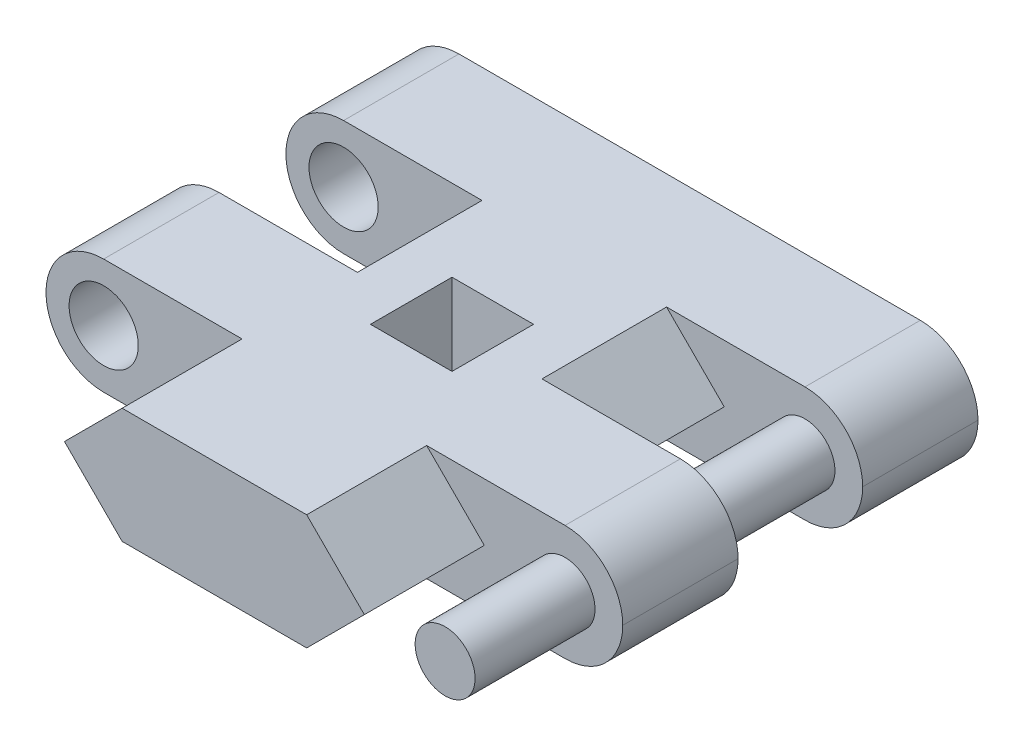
ISO-10303-21;
HEADER;
FILE_DESCRIPTION(('STEP AP214'),'2;1');
FILE_NAME('part.step','',(''),(''),'','','');
FILE_SCHEMA(('AUTOMOTIVE_DESIGN { 1 0 10303 214 1 1 1 1 }'));
ENDSEC;
DATA;
#1=APPLICATION_CONTEXT('core data for automotive mechanical design processes');
#2=APPLICATION_PROTOCOL_DEFINITION('international standard','automotive_design',2000,#1);
#3=PRODUCT_CONTEXT('',#1,'mechanical');
#4=PRODUCT('Part','Part','',(#3));
#5=PRODUCT_RELATED_PRODUCT_CATEGORY('part','',(#4));
#6=PRODUCT_DEFINITION_FORMATION('','',#4);
#7=PRODUCT_DEFINITION_CONTEXT('part definition',#1,'design');
#8=PRODUCT_DEFINITION('design','',#6,#7);
#9=PRODUCT_DEFINITION_SHAPE('','',#8);
#10=(LENGTH_UNIT() NAMED_UNIT(*) SI_UNIT(.MILLI.,.METRE.));
#11=(NAMED_UNIT(*) PLANE_ANGLE_UNIT() SI_UNIT($,.RADIAN.));
#12=(NAMED_UNIT(*) SI_UNIT($,.STERADIAN.) SOLID_ANGLE_UNIT());
#13=UNCERTAINTY_MEASURE_WITH_UNIT(LENGTH_MEASURE(1.E-05),#10,'distance_accuracy_value','');
#14=(GEOMETRIC_REPRESENTATION_CONTEXT(3) GLOBAL_UNCERTAINTY_ASSIGNED_CONTEXT((#13)) GLOBAL_UNIT_ASSIGNED_CONTEXT((#10,
#11,#12)) REPRESENTATION_CONTEXT('',''));
#15=CARTESIAN_POINT('',(0.,0.,0.));
#16=DIRECTION('',(0.,0.,1.));
#17=DIRECTION('',(1.,0.,0.));
#18=AXIS2_PLACEMENT_3D('',#15,#16,#17);
#19=CARTESIAN_POINT('',(0.,2.5,-10.3));
#20=DIRECTION('',(0.,0.,1.));
#21=DIRECTION('',(1.,0.,0.));
#22=AXIS2_PLACEMENT_3D('',#19,#20,#21);
#23=PLANE('',#22);
#24=CARTESIAN_POINT('',(-10.,0.,-10.3));
#25=DIRECTION('',(0.,0.,-1.));
#26=DIRECTION('',(-1.,0.,0.));
#27=AXIS2_PLACEMENT_3D('',#24,#25,#26);
#28=CIRCLE('',#27,1.5);
#29=CARTESIAN_POINT('',(-11.5,0.,-10.3));
#30=VERTEX_POINT('',#29);
#31=EDGE_CURVE('E258',#30,#30,#28,.T.);
#32=ORIENTED_EDGE('',*,*,#31,.F.);
#33=EDGE_LOOP('',(#32));
#34=FACE_BOUND('',#33,.T.);
#35=DIRECTION('',(-1.,0.,0.));
#36=VECTOR('',#35,1.);
#37=CARTESIAN_POINT('',(0.,2.5,-10.3));
#38=LINE('',#37,#36);
#39=CARTESIAN_POINT('',(10.,2.5,-10.3));
#40=VERTEX_POINT('',#39);
#41=CARTESIAN_POINT('',(-10.,2.5,-10.3));
#42=VERTEX_POINT('',#41);
#43=EDGE_CURVE('E287',#40,#42,#38,.T.);
#44=ORIENTED_EDGE('',*,*,#43,.F.);
#45=CARTESIAN_POINT('',(10.,0.,-10.3));
#46=DIRECTION('',(0.,0.,1.));
#47=DIRECTION('',(1.,0.,0.));
#48=AXIS2_PLACEMENT_3D('',#45,#46,#47);
#49=CIRCLE('',#48,2.5);
#50=CARTESIAN_POINT('',(12.5,0.,-10.3));
#51=VERTEX_POINT('',#50);
#52=EDGE_CURVE('E393',#40,#51,#49,.F.);
#53=ORIENTED_EDGE('',*,*,#52,.T.);
#54=CARTESIAN_POINT('',(10.,0.,-10.3));
#55=DIRECTION('',(0.,0.,1.));
#56=DIRECTION('',(1.,0.,0.));
#57=AXIS2_PLACEMENT_3D('',#54,#55,#56);
#58=CIRCLE('',#57,2.5);
#59=CARTESIAN_POINT('',(10.,-2.5,-10.3));
#60=VERTEX_POINT('',#59);
#61=EDGE_CURVE('E391',#51,#60,#58,.F.);
#62=ORIENTED_EDGE('',*,*,#61,.T.);
#63=DIRECTION('',(-1.,0.,0.));
#64=VECTOR('',#63,1.);
#65=CARTESIAN_POINT('',(0.,-2.5,-10.3));
#66=LINE('',#65,#64);
#67=CARTESIAN_POINT('',(-10.,-2.5,-10.3));
#68=VERTEX_POINT('',#67);
#69=EDGE_CURVE('E301',#60,#68,#66,.T.);
#70=ORIENTED_EDGE('',*,*,#69,.T.);
#71=CARTESIAN_POINT('',(-10.,0.,-10.3));
#72=DIRECTION('',(0.,0.,1.));
#73=DIRECTION('',(1.,0.,0.));
#74=AXIS2_PLACEMENT_3D('',#71,#72,#73);
#75=CIRCLE('',#74,2.5);
#76=CARTESIAN_POINT('',(-12.5,0.,-10.3));
#77=VERTEX_POINT('',#76);
#78=EDGE_CURVE('E322',#68,#77,#75,.F.);
#79=ORIENTED_EDGE('',*,*,#78,.T.);
#80=CARTESIAN_POINT('',(-10.,0.,-10.3));
#81=DIRECTION('',(0.,0.,1.));
#82=DIRECTION('',(1.,0.,0.));
#83=AXIS2_PLACEMENT_3D('',#80,#81,#82);
#84=CIRCLE('',#83,2.5);
#85=EDGE_CURVE('E324',#77,#42,#84,.F.);
#86=ORIENTED_EDGE('',*,*,#85,.T.);
#87=EDGE_LOOP('',(#44,#53,#62,#70,#79,#86));
#88=FACE_BOUND('',#87,.T.);
#89=ADVANCED_FACE('F32',(#34,#88),#23,.F.);
#90=CARTESIAN_POINT('',(-12.5,2.5,-5.3));
#91=DIRECTION('',(0.,0.,-1.));
#92=DIRECTION('',(-1.,0.,0.));
#93=AXIS2_PLACEMENT_3D('',#90,#91,#92);
#94=PLANE('',#93);
#95=CARTESIAN_POINT('',(-10.,0.,-5.3));
#96=DIRECTION('',(0.,0.,-1.));
#97=DIRECTION('',(-1.,0.,0.));
#98=AXIS2_PLACEMENT_3D('',#95,#96,#97);
#99=CIRCLE('',#98,1.5);
#100=CARTESIAN_POINT('',(-11.5,0.,-5.3));
#101=VERTEX_POINT('',#100);
#102=EDGE_CURVE('E267',#101,#101,#99,.T.);
#103=ORIENTED_EDGE('',*,*,#102,.T.);
#104=EDGE_LOOP('',(#103));
#105=FACE_BOUND('',#104,.T.);
#106=DIRECTION('',(1.,0.,0.));
#107=VECTOR('',#106,1.);
#108=CARTESIAN_POINT('',(-12.5,2.5,-5.3));
#109=LINE('',#108,#107);
#110=CARTESIAN_POINT('',(-10.,2.5,-5.3));
#111=VERTEX_POINT('',#110);
#112=CARTESIAN_POINT('',(-4.00000000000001,2.5,-5.3));
#113=VERTEX_POINT('',#112);
#114=EDGE_CURVE('E289',#111,#113,#109,.T.);
#115=ORIENTED_EDGE('',*,*,#114,.F.);
#116=CARTESIAN_POINT('',(-10.,0.,-5.3));
#117=DIRECTION('',(0.,0.,-1.));
#118=DIRECTION('',(-1.,0.,0.));
#119=AXIS2_PLACEMENT_3D('',#116,#117,#118);
#120=CIRCLE('',#119,2.5);
#121=CARTESIAN_POINT('',(-12.5,0.,-5.3));
#122=VERTEX_POINT('',#121);
#123=EDGE_CURVE('E320',#111,#122,#120,.F.);
#124=ORIENTED_EDGE('',*,*,#123,.T.);
#125=CARTESIAN_POINT('',(-10.,0.,-5.3));
#126=DIRECTION('',(0.,0.,-1.));
#127=DIRECTION('',(-1.,0.,0.));
#128=AXIS2_PLACEMENT_3D('',#125,#126,#127);
#129=CIRCLE('',#128,2.5);
#130=CARTESIAN_POINT('',(-10.,-2.5,-5.3));
#131=VERTEX_POINT('',#130);
#132=EDGE_CURVE('E318',#122,#131,#129,.F.);
#133=ORIENTED_EDGE('',*,*,#132,.T.);
#134=DIRECTION('',(1.,0.,0.));
#135=VECTOR('',#134,1.);
#136=CARTESIAN_POINT('',(-12.5,-2.5,-5.3));
#137=LINE('',#136,#135);
#138=CARTESIAN_POINT('',(-3.99999999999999,-2.5,-5.3));
#139=VERTEX_POINT('',#138);
#140=EDGE_CURVE('E303',#131,#139,#137,.T.);
#141=ORIENTED_EDGE('',*,*,#140,.T.);
#142=DIRECTION('',(0.707106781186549,-0.707106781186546,0.));
#143=VECTOR('',#142,1.);
#144=CARTESIAN_POINT('',(-10.75,4.24999999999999,-5.3));
#145=LINE('',#144,#143);
#146=CARTESIAN_POINT('',(-6.5,0.,-5.3));
#147=VERTEX_POINT('',#146);
#148=EDGE_CURVE('E375',#139,#147,#145,.F.);
#149=ORIENTED_EDGE('',*,*,#148,.T.);
#150=DIRECTION('',(0.707106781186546,0.707106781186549,0.));
#151=VECTOR('',#150,1.);
#152=CARTESIAN_POINT('',(-8.24999999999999,-1.75,-5.3));
#153=LINE('',#152,#151);
#154=EDGE_CURVE('E364',#147,#113,#153,.T.);
#155=ORIENTED_EDGE('',*,*,#154,.T.);
#156=EDGE_LOOP('',(#115,#124,#133,#141,#149,#155));
#157=FACE_BOUND('',#156,.T.);
#158=ADVANCED_FACE('F463',(#105,#157),#94,.F.);
#159=CARTESIAN_POINT('',(-6.5,2.5,0.1));
#160=DIRECTION('',(0.,0.,1.));
#161=DIRECTION('',(1.,0.,0.));
#162=AXIS2_PLACEMENT_3D('',#159,#160,#161);
#163=PLANE('',#162);
#164=CARTESIAN_POINT('',(-10.,0.,0.0999999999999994));
#165=DIRECTION('',(0.,0.,1.));
#166=DIRECTION('',(1.,0.,0.));
#167=AXIS2_PLACEMENT_3D('',#164,#165,#166);
#168=CIRCLE('',#167,1.5);
#169=CARTESIAN_POINT('',(-11.5,0.,0.0999999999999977));
#170=VERTEX_POINT('',#169);
#171=EDGE_CURVE('E264',#170,#170,#168,.T.);
#172=ORIENTED_EDGE('',*,*,#171,.T.);
#173=EDGE_LOOP('',(#172));
#174=FACE_BOUND('',#173,.T.);
#175=CARTESIAN_POINT('',(-10.,0.,0.1));
#176=DIRECTION('',(0.,0.,1.));
#177=DIRECTION('',(1.,0.,0.));
#178=AXIS2_PLACEMENT_3D('',#175,#176,#177);
#179=CIRCLE('',#178,2.5);
#180=CARTESIAN_POINT('',(-10.,-2.5,0.1));
#181=VERTEX_POINT('',#180);
#182=CARTESIAN_POINT('',(-12.5,0.,0.1));
#183=VERTEX_POINT('',#182);
#184=EDGE_CURVE('E331',#181,#183,#179,.F.);
#185=ORIENTED_EDGE('',*,*,#184,.T.);
#186=CARTESIAN_POINT('',(-10.,0.,0.1));
#187=DIRECTION('',(0.,0.,1.));
#188=DIRECTION('',(1.,0.,0.));
#189=AXIS2_PLACEMENT_3D('',#186,#187,#188);
#190=CIRCLE('',#189,2.5);
#191=CARTESIAN_POINT('',(-10.,2.5,0.1));
#192=VERTEX_POINT('',#191);
#193=EDGE_CURVE('E333',#183,#192,#190,.F.);
#194=ORIENTED_EDGE('',*,*,#193,.T.);
#195=DIRECTION('',(-1.,0.,0.));
#196=VECTOR('',#195,1.);
#197=CARTESIAN_POINT('',(-6.5,2.5,0.1));
#198=LINE('',#197,#196);
#199=CARTESIAN_POINT('',(-4.00000000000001,2.5,0.1));
#200=VERTEX_POINT('',#199);
#201=EDGE_CURVE('E292',#200,#192,#198,.T.);
#202=ORIENTED_EDGE('',*,*,#201,.F.);
#203=DIRECTION('',(-0.707106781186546,-0.707106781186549,0.));
#204=VECTOR('',#203,1.);
#205=CARTESIAN_POINT('',(-5.25,1.25,0.1));
#206=LINE('',#205,#204);
#207=CARTESIAN_POINT('',(-6.5,0.,0.1));
#208=VERTEX_POINT('',#207);
#209=EDGE_CURVE('E362',#200,#208,#206,.T.);
#210=ORIENTED_EDGE('',*,*,#209,.T.);
#211=DIRECTION('',(-0.707106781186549,0.707106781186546,0.));
#212=VECTOR('',#211,1.);
#213=CARTESIAN_POINT('',(-7.75,1.24999999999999,0.1));
#214=LINE('',#213,#212);
#215=CARTESIAN_POINT('',(-3.99999999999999,-2.5,0.1));
#216=VERTEX_POINT('',#215);
#217=EDGE_CURVE('E372',#208,#216,#214,.F.);
#218=ORIENTED_EDGE('',*,*,#217,.T.);
#219=DIRECTION('',(-1.,0.,0.));
#220=VECTOR('',#219,1.);
#221=CARTESIAN_POINT('',(-6.5,-2.5,0.1));
#222=LINE('',#221,#220);
#223=EDGE_CURVE('E306',#216,#181,#222,.T.);
#224=ORIENTED_EDGE('',*,*,#223,.T.);
#225=EDGE_LOOP('',(#185,#194,#202,#210,#218,#224));
#226=FACE_BOUND('',#225,.T.);
#227=ADVANCED_FACE('F460',(#174,#226),#163,.F.);
#228=CARTESIAN_POINT('',(-12.5,2.5,5.1));
#229=DIRECTION('',(0.,0.,-1.));
#230=DIRECTION('',(-1.,0.,0.));
#231=AXIS2_PLACEMENT_3D('',#228,#229,#230);
#232=PLANE('',#231);
#233=CARTESIAN_POINT('',(-10.,0.,5.1));
#234=DIRECTION('',(0.,0.,-1.));
#235=DIRECTION('',(-1.,0.,0.));
#236=AXIS2_PLACEMENT_3D('',#233,#234,#235);
#237=CIRCLE('',#236,1.5);
#238=CARTESIAN_POINT('',(-11.5,0.,5.1));
#239=VERTEX_POINT('',#238);
#240=EDGE_CURVE('E263',#239,#239,#237,.T.);
#241=ORIENTED_EDGE('',*,*,#240,.T.);
#242=EDGE_LOOP('',(#241));
#243=FACE_BOUND('',#242,.T.);
#244=DIRECTION('',(1.,0.,0.));
#245=VECTOR('',#244,1.);
#246=CARTESIAN_POINT('',(-12.5,2.5,5.1));
#247=LINE('',#246,#245);
#248=CARTESIAN_POINT('',(-10.,2.5,5.1));
#249=VERTEX_POINT('',#248);
#250=CARTESIAN_POINT('',(-4.00000000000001,2.5,5.1));
#251=VERTEX_POINT('',#250);
#252=EDGE_CURVE('E295',#249,#251,#247,.T.);
#253=ORIENTED_EDGE('',*,*,#252,.F.);
#254=CARTESIAN_POINT('',(-10.,0.,5.1));
#255=DIRECTION('',(0.,0.,-1.));
#256=DIRECTION('',(-1.,0.,0.));
#257=AXIS2_PLACEMENT_3D('',#254,#255,#256);
#258=CIRCLE('',#257,2.5);
#259=CARTESIAN_POINT('',(-12.5,0.,5.1));
#260=VERTEX_POINT('',#259);
#261=EDGE_CURVE('E329',#249,#260,#258,.F.);
#262=ORIENTED_EDGE('',*,*,#261,.T.);
#263=CARTESIAN_POINT('',(-10.,0.,5.1));
#264=DIRECTION('',(0.,0.,-1.));
#265=DIRECTION('',(-1.,0.,0.));
#266=AXIS2_PLACEMENT_3D('',#263,#264,#265);
#267=CIRCLE('',#266,2.5);
#268=CARTESIAN_POINT('',(-10.,-2.5,5.1));
#269=VERTEX_POINT('',#268);
#270=EDGE_CURVE('E327',#260,#269,#267,.F.);
#271=ORIENTED_EDGE('',*,*,#270,.T.);
#272=DIRECTION('',(1.,0.,0.));
#273=VECTOR('',#272,1.);
#274=CARTESIAN_POINT('',(-12.5,-2.5,5.1));
#275=LINE('',#274,#273);
#276=CARTESIAN_POINT('',(-3.99999999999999,-2.5,5.1));
#277=VERTEX_POINT('',#276);
#278=EDGE_CURVE('E309',#269,#277,#275,.T.);
#279=ORIENTED_EDGE('',*,*,#278,.T.);
#280=DIRECTION('',(0.707106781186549,-0.707106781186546,0.));
#281=VECTOR('',#280,1.);
#282=CARTESIAN_POINT('',(-10.75,4.24999999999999,5.1));
#283=LINE('',#282,#281);
#284=CARTESIAN_POINT('',(-6.5,0.,5.1));
#285=VERTEX_POINT('',#284);
#286=EDGE_CURVE('E370',#277,#285,#283,.F.);
#287=ORIENTED_EDGE('',*,*,#286,.T.);
#288=DIRECTION('',(0.707106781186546,0.707106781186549,0.));
#289=VECTOR('',#288,1.);
#290=CARTESIAN_POINT('',(-8.24999999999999,-1.75,5.1));
#291=LINE('',#290,#289);
#292=EDGE_CURVE('E367',#285,#251,#291,.T.);
#293=ORIENTED_EDGE('',*,*,#292,.T.);
#294=EDGE_LOOP('',(#253,#262,#271,#279,#287,#293));
#295=FACE_BOUND('',#294,.T.);
#296=ADVANCED_FACE('F449',(#243,#295),#232,.F.);
#297=CARTESIAN_POINT('',(-6.5,2.5,10.3));
#298=DIRECTION('',(0.,0.,-1.));
#299=DIRECTION('',(-1.,0.,0.));
#300=AXIS2_PLACEMENT_3D('',#297,#298,#299);
#301=PLANE('',#300);
#302=DIRECTION('',(0.707106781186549,0.707106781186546,0.));
#303=VECTOR('',#302,1.);
#304=CARTESIAN_POINT('',(3.99999999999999,-2.5,10.3));
#305=LINE('',#304,#303);
#306=CARTESIAN_POINT('',(3.99999999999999,-2.5,10.3));
#307=VERTEX_POINT('',#306);
#308=CARTESIAN_POINT('',(6.5,0.,10.3));
#309=VERTEX_POINT('',#308);
#310=EDGE_CURVE('E419',#307,#309,#305,.T.);
#311=ORIENTED_EDGE('',*,*,#310,.T.);
#312=DIRECTION('',(0.707106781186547,-0.707106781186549,0.));
#313=VECTOR('',#312,1.);
#314=CARTESIAN_POINT('',(6.5,0.,10.3));
#315=LINE('',#314,#313);
#316=CARTESIAN_POINT('',(4.,2.5,10.3));
#317=VERTEX_POINT('',#316);
#318=EDGE_CURVE('E421',#309,#317,#315,.F.);
#319=ORIENTED_EDGE('',*,*,#318,.T.);
#320=DIRECTION('',(1.,0.,0.));
#321=VECTOR('',#320,1.);
#322=CARTESIAN_POINT('',(-6.5,2.5,10.3));
#323=LINE('',#322,#321);
#324=CARTESIAN_POINT('',(-4.00000000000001,2.5,10.3));
#325=VERTEX_POINT('',#324);
#326=EDGE_CURVE('E297',#325,#317,#323,.T.);
#327=ORIENTED_EDGE('',*,*,#326,.F.);
#328=DIRECTION('',(-0.707106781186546,-0.707106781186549,0.));
#329=VECTOR('',#328,1.);
#330=CARTESIAN_POINT('',(-4.00000000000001,2.5,10.3));
#331=LINE('',#330,#329);
#332=CARTESIAN_POINT('',(-6.5,0.,10.3));
#333=VERTEX_POINT('',#332);
#334=EDGE_CURVE('E354',#325,#333,#331,.T.);
#335=ORIENTED_EDGE('',*,*,#334,.T.);
#336=DIRECTION('',(-0.707106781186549,0.707106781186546,0.));
#337=VECTOR('',#336,1.);
#338=CARTESIAN_POINT('',(-6.5,0.,10.3));
#339=LINE('',#338,#337);
#340=CARTESIAN_POINT('',(-3.99999999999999,-2.5,10.3));
#341=VERTEX_POINT('',#340);
#342=EDGE_CURVE('E352',#333,#341,#339,.F.);
#343=ORIENTED_EDGE('',*,*,#342,.T.);
#344=DIRECTION('',(1.,0.,0.));
#345=VECTOR('',#344,1.);
#346=CARTESIAN_POINT('',(-6.5,-2.5,10.3));
#347=LINE('',#346,#345);
#348=EDGE_CURVE('E290',#341,#307,#347,.T.);
#349=ORIENTED_EDGE('',*,*,#348,.T.);
#350=EDGE_LOOP('',(#311,#319,#327,#335,#343,#349));
#351=FACE_BOUND('',#350,.T.);
#352=ADVANCED_FACE('F485',(#351),#301,.F.);
#353=CARTESIAN_POINT('',(0.,2.5,0.));
#354=DIRECTION('',(0.,1.,0.));
#355=DIRECTION('',(0.,0.,1.));
#356=AXIS2_PLACEMENT_3D('',#353,#354,#355);
#357=PLANE('',#356);
#358=DIRECTION('',(0.,0.,1.));
#359=VECTOR('',#358,1.);
#360=CARTESIAN_POINT('',(1.76776695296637,2.5,1.76776695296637));
#361=LINE('',#360,#359);
#362=CARTESIAN_POINT('',(1.76776695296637,2.5,-1.76776695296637));
#363=VERTEX_POINT('',#362);
#364=CARTESIAN_POINT('',(1.76776695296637,2.5,1.76776695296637));
#365=VERTEX_POINT('',#364);
#366=EDGE_CURVE('E221',#363,#365,#361,.T.);
#367=ORIENTED_EDGE('',*,*,#366,.T.);
#368=DIRECTION('',(-1.,0.,0.));
#369=VECTOR('',#368,1.);
#370=CARTESIAN_POINT('',(-1.76776695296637,2.5,1.76776695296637));
#371=LINE('',#370,#369);
#372=CARTESIAN_POINT('',(-1.76776695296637,2.5,1.76776695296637));
#373=VERTEX_POINT('',#372);
#374=EDGE_CURVE('E230',#365,#373,#371,.T.);
#375=ORIENTED_EDGE('',*,*,#374,.T.);
#376=DIRECTION('',(0.,0.,-1.));
#377=VECTOR('',#376,1.);
#378=CARTESIAN_POINT('',(-1.76776695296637,2.5,1.76776695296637));
#379=LINE('',#378,#377);
#380=CARTESIAN_POINT('',(-1.76776695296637,2.5,-1.76776695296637));
#381=VERTEX_POINT('',#380);
#382=EDGE_CURVE('E49',#373,#381,#379,.T.);
#383=ORIENTED_EDGE('',*,*,#382,.T.);
#384=DIRECTION('',(1.,0.,0.));
#385=VECTOR('',#384,1.);
#386=CARTESIAN_POINT('',(-1.76776695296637,2.5,-1.76776695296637));
#387=LINE('',#386,#385);
#388=EDGE_CURVE('E227',#381,#363,#387,.T.);
#389=ORIENTED_EDGE('',*,*,#388,.T.);
#390=EDGE_LOOP('',(#367,#375,#383,#389));
#391=FACE_BOUND('',#390,.T.);
#392=DIRECTION('',(1.,0.,0.));
#393=VECTOR('',#392,1.);
#394=CARTESIAN_POINT('',(6.5,2.5,0.1));
#395=LINE('',#394,#393);
#396=CARTESIAN_POINT('',(4.,2.5,0.1));
#397=VERTEX_POINT('',#396);
#398=CARTESIAN_POINT('',(10.,2.5,0.1));
#399=VERTEX_POINT('',#398);
#400=EDGE_CURVE('E273',#397,#399,#395,.T.);
#401=ORIENTED_EDGE('',*,*,#400,.F.);
#402=DIRECTION('',(0.,0.,-1.));
#403=VECTOR('',#402,1.);
#404=CARTESIAN_POINT('',(4.,2.5,0.));
#405=LINE('',#404,#403);
#406=CARTESIAN_POINT('',(4.,2.5,-5.3));
#407=VERTEX_POINT('',#406);
#408=EDGE_CURVE('E416',#397,#407,#405,.T.);
#409=ORIENTED_EDGE('',*,*,#408,.T.);
#410=DIRECTION('',(-1.,0.,0.));
#411=VECTOR('',#410,1.);
#412=CARTESIAN_POINT('',(12.5,2.5,-5.3));
#413=LINE('',#412,#411);
#414=CARTESIAN_POINT('',(10.,2.5,-5.3));
#415=VERTEX_POINT('',#414);
#416=EDGE_CURVE('E277',#415,#407,#413,.T.);
#417=ORIENTED_EDGE('',*,*,#416,.F.);
#418=DIRECTION('',(0.,0.,1.));
#419=VECTOR('',#418,1.);
#420=CARTESIAN_POINT('',(10.,2.5,0.));
#421=LINE('',#420,#419);
#422=EDGE_CURVE('E388',#415,#40,#421,.F.);
#423=ORIENTED_EDGE('',*,*,#422,.T.);
#424=ORIENTED_EDGE('',*,*,#43,.T.);
#425=DIRECTION('',(0.,0.,1.));
#426=VECTOR('',#425,1.);
#427=CARTESIAN_POINT('',(-10.,2.5,-5.3));
#428=LINE('',#427,#426);
#429=EDGE_CURVE('E315',#42,#111,#428,.T.);
#430=ORIENTED_EDGE('',*,*,#429,.T.);
#431=ORIENTED_EDGE('',*,*,#114,.T.);
#432=DIRECTION('',(0.,0.,1.));
#433=VECTOR('',#432,1.);
#434=CARTESIAN_POINT('',(-4.00000000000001,2.5,0.1));
#435=LINE('',#434,#433);
#436=EDGE_CURVE('E349',#113,#200,#435,.T.);
#437=ORIENTED_EDGE('',*,*,#436,.T.);
#438=ORIENTED_EDGE('',*,*,#201,.T.);
#439=DIRECTION('',(0.,0.,1.));
#440=VECTOR('',#439,1.);
#441=CARTESIAN_POINT('',(-10.,2.5,5.1));
#442=LINE('',#441,#440);
#443=EDGE_CURVE('E300',#192,#249,#442,.T.);
#444=ORIENTED_EDGE('',*,*,#443,.T.);
#445=ORIENTED_EDGE('',*,*,#252,.T.);
#446=DIRECTION('',(0.,0.,1.));
#447=VECTOR('',#446,1.);
#448=CARTESIAN_POINT('',(-4.00000000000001,2.5,10.3));
#449=LINE('',#448,#447);
#450=EDGE_CURVE('E340',#251,#325,#449,.T.);
#451=ORIENTED_EDGE('',*,*,#450,.T.);
#452=ORIENTED_EDGE('',*,*,#326,.T.);
#453=DIRECTION('',(0.,0.,-1.));
#454=VECTOR('',#453,1.);
#455=CARTESIAN_POINT('',(4.,2.5,0.));
#456=LINE('',#455,#454);
#457=CARTESIAN_POINT('',(4.,2.5,5.1));
#458=VERTEX_POINT('',#457);
#459=EDGE_CURVE('E407',#317,#458,#456,.T.);
#460=ORIENTED_EDGE('',*,*,#459,.T.);
#461=DIRECTION('',(-1.,0.,0.));
#462=VECTOR('',#461,1.);
#463=CARTESIAN_POINT('',(12.5,2.5,5.1));
#464=LINE('',#463,#462);
#465=CARTESIAN_POINT('',(10.,2.5,5.1));
#466=VERTEX_POINT('',#465);
#467=EDGE_CURVE('E271',#466,#458,#464,.T.);
#468=ORIENTED_EDGE('',*,*,#467,.F.);
#469=DIRECTION('',(0.,0.,1.));
#470=VECTOR('',#469,1.);
#471=CARTESIAN_POINT('',(10.,2.5,0.));
#472=LINE('',#471,#470);
#473=EDGE_CURVE('E385',#466,#399,#472,.F.);
#474=ORIENTED_EDGE('',*,*,#473,.T.);
#475=EDGE_LOOP('',(#401,#409,#417,#423,#424,#430,#431,#437,#438,#444,#445,#451,#452,#460,#468,#474));
#476=FACE_BOUND('',#475,.T.);
#477=ADVANCED_FACE('F234',(#391,#476),#357,.T.);
#478=CARTESIAN_POINT('',(0.,-2.5,0.));
#479=DIRECTION('',(0.,1.,0.));
#480=DIRECTION('',(0.,0.,1.));
#481=AXIS2_PLACEMENT_3D('',#478,#479,#480);
#482=PLANE('',#481);
#483=DIRECTION('',(-1.,0.,0.));
#484=VECTOR('',#483,1.);
#485=CARTESIAN_POINT('',(-1.76776695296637,-2.5,1.76776695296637));
#486=LINE('',#485,#484);
#487=CARTESIAN_POINT('',(1.76776695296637,-2.5,1.76776695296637));
#488=VERTEX_POINT('',#487);
#489=CARTESIAN_POINT('',(-1.76776695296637,-2.5,1.76776695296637));
#490=VERTEX_POINT('',#489);
#491=EDGE_CURVE('E246',#488,#490,#486,.T.);
#492=ORIENTED_EDGE('',*,*,#491,.F.);
#493=DIRECTION('',(0.,0.,1.));
#494=VECTOR('',#493,1.);
#495=CARTESIAN_POINT('',(1.76776695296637,-2.5,1.76776695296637));
#496=LINE('',#495,#494);
#497=CARTESIAN_POINT('',(1.76776695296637,-2.5,-1.76776695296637));
#498=VERTEX_POINT('',#497);
#499=EDGE_CURVE('E57',#498,#488,#496,.T.);
#500=ORIENTED_EDGE('',*,*,#499,.F.);
#501=DIRECTION('',(1.,0.,0.));
#502=VECTOR('',#501,1.);
#503=CARTESIAN_POINT('',(-1.76776695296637,-2.5,-1.76776695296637));
#504=LINE('',#503,#502);
#505=CARTESIAN_POINT('',(-1.76776695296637,-2.5,-1.76776695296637));
#506=VERTEX_POINT('',#505);
#507=EDGE_CURVE('E237',#506,#498,#504,.T.);
#508=ORIENTED_EDGE('',*,*,#507,.F.);
#509=DIRECTION('',(0.,0.,-1.));
#510=VECTOR('',#509,1.);
#511=CARTESIAN_POINT('',(-1.76776695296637,-2.5,1.76776695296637));
#512=LINE('',#511,#510);
#513=EDGE_CURVE('E240',#490,#506,#512,.T.);
#514=ORIENTED_EDGE('',*,*,#513,.F.);
#515=EDGE_LOOP('',(#492,#500,#508,#514));
#516=FACE_BOUND('',#515,.T.);
#517=DIRECTION('',(-1.,0.,0.));
#518=VECTOR('',#517,1.);
#519=CARTESIAN_POINT('',(12.5,-2.5,5.1));
#520=LINE('',#519,#518);
#521=CARTESIAN_POINT('',(10.,-2.5,5.1));
#522=VERTEX_POINT('',#521);
#523=CARTESIAN_POINT('',(3.99999999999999,-2.5,5.1));
#524=VERTEX_POINT('',#523);
#525=EDGE_CURVE('E280',#522,#524,#520,.T.);
#526=ORIENTED_EDGE('',*,*,#525,.T.);
#527=DIRECTION('',(0.,0.,1.));
#528=VECTOR('',#527,1.);
#529=CARTESIAN_POINT('',(3.99999999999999,-2.5,10.3));
#530=LINE('',#529,#528);
#531=EDGE_CURVE('E426',#524,#307,#530,.T.);
#532=ORIENTED_EDGE('',*,*,#531,.T.);
#533=ORIENTED_EDGE('',*,*,#348,.F.);
#534=DIRECTION('',(0.,0.,-1.));
#535=VECTOR('',#534,1.);
#536=CARTESIAN_POINT('',(-3.99999999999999,-2.5,0.));
#537=LINE('',#536,#535);
#538=EDGE_CURVE('E359',#341,#277,#537,.T.);
#539=ORIENTED_EDGE('',*,*,#538,.T.);
#540=ORIENTED_EDGE('',*,*,#278,.F.);
#541=DIRECTION('',(0.,0.,1.));
#542=VECTOR('',#541,1.);
#543=CARTESIAN_POINT('',(-10.,-2.5,0.));
#544=LINE('',#543,#542);
#545=EDGE_CURVE('E338',#269,#181,#544,.F.);
#546=ORIENTED_EDGE('',*,*,#545,.T.);
#547=ORIENTED_EDGE('',*,*,#223,.F.);
#548=DIRECTION('',(0.,0.,-1.));
#549=VECTOR('',#548,1.);
#550=CARTESIAN_POINT('',(-3.99999999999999,-2.5,0.));
#551=LINE('',#550,#549);
#552=EDGE_CURVE('E356',#216,#139,#551,.T.);
#553=ORIENTED_EDGE('',*,*,#552,.T.);
#554=ORIENTED_EDGE('',*,*,#140,.F.);
#555=DIRECTION('',(0.,0.,1.));
#556=VECTOR('',#555,1.);
#557=CARTESIAN_POINT('',(-10.,-2.5,0.));
#558=LINE('',#557,#556);
#559=EDGE_CURVE('E335',#131,#68,#558,.F.);
#560=ORIENTED_EDGE('',*,*,#559,.T.);
#561=ORIENTED_EDGE('',*,*,#69,.F.);
#562=DIRECTION('',(0.,0.,1.));
#563=VECTOR('',#562,1.);
#564=CARTESIAN_POINT('',(10.,-2.5,-5.3));
#565=LINE('',#564,#563);
#566=CARTESIAN_POINT('',(10.,-2.5,-5.3));
#567=VERTEX_POINT('',#566);
#568=EDGE_CURVE('E403',#60,#567,#565,.T.);
#569=ORIENTED_EDGE('',*,*,#568,.T.);
#570=DIRECTION('',(-1.,0.,0.));
#571=VECTOR('',#570,1.);
#572=CARTESIAN_POINT('',(12.5,-2.5,-5.3));
#573=LINE('',#572,#571);
#574=CARTESIAN_POINT('',(3.99999999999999,-2.5,-5.3));
#575=VERTEX_POINT('',#574);
#576=EDGE_CURVE('E274',#567,#575,#573,.T.);
#577=ORIENTED_EDGE('',*,*,#576,.T.);
#578=DIRECTION('',(0.,0.,1.));
#579=VECTOR('',#578,1.);
#580=CARTESIAN_POINT('',(3.99999999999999,-2.5,0.1));
#581=LINE('',#580,#579);
#582=CARTESIAN_POINT('',(3.99999999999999,-2.5,0.1));
#583=VERTEX_POINT('',#582);
#584=EDGE_CURVE('E423',#575,#583,#581,.T.);
#585=ORIENTED_EDGE('',*,*,#584,.T.);
#586=DIRECTION('',(1.,0.,0.));
#587=VECTOR('',#586,1.);
#588=CARTESIAN_POINT('',(6.5,-2.5,0.1));
#589=LINE('',#588,#587);
#590=CARTESIAN_POINT('',(10.,-2.5,0.1));
#591=VERTEX_POINT('',#590);
#592=EDGE_CURVE('E282',#583,#591,#589,.T.);
#593=ORIENTED_EDGE('',*,*,#592,.T.);
#594=DIRECTION('',(0.,0.,1.));
#595=VECTOR('',#594,1.);
#596=CARTESIAN_POINT('',(10.,-2.5,5.1));
#597=LINE('',#596,#595);
#598=EDGE_CURVE('E405',#591,#522,#597,.T.);
#599=ORIENTED_EDGE('',*,*,#598,.T.);
#600=EDGE_LOOP('',(#526,#532,#533,#539,#540,#546,#547,#553,#554,#560,#561,#569,#577,#585,#593,#599));
#601=FACE_BOUND('',#600,.T.);
#602=ADVANCED_FACE('F508',(#516,#601),#482,.F.);
#603=CARTESIAN_POINT('',(-10.,0.,-10.3));
#604=DIRECTION('',(0.,0.,1.));
#605=DIRECTION('',(1.,0.,0.));
#606=AXIS2_PLACEMENT_3D('',#603,#604,#605);
#607=CYLINDRICAL_SURFACE('',#606,2.5);
#608=DIRECTION('',(0.,0.,1.));
#609=VECTOR('',#608,1.);
#610=CARTESIAN_POINT('',(-12.5,0.,-10.3));
#611=LINE('',#610,#609);
#612=EDGE_CURVE('E304',#77,#122,#611,.T.);
#613=ORIENTED_EDGE('',*,*,#612,.F.);
#614=ORIENTED_EDGE('',*,*,#78,.F.);
#615=ORIENTED_EDGE('',*,*,#559,.F.);
#616=ORIENTED_EDGE('',*,*,#132,.F.);
#617=EDGE_LOOP('',(#613,#614,#615,#616));
#618=FACE_BOUND('',#617,.T.);
#619=ADVANCED_FACE('F536',(#618),#607,.T.);
#620=CARTESIAN_POINT('',(-10.,0.,0.));
#621=DIRECTION('',(0.,0.,-1.));
#622=DIRECTION('',(-1.,0.,0.));
#623=AXIS2_PLACEMENT_3D('',#620,#621,#622);
#624=CYLINDRICAL_SURFACE('',#623,2.5);
#625=ORIENTED_EDGE('',*,*,#85,.F.);
#626=ORIENTED_EDGE('',*,*,#612,.T.);
#627=ORIENTED_EDGE('',*,*,#123,.F.);
#628=ORIENTED_EDGE('',*,*,#429,.F.);
#629=EDGE_LOOP('',(#625,#626,#627,#628));
#630=FACE_BOUND('',#629,.T.);
#631=ADVANCED_FACE('F567',(#630),#624,.T.);
#632=CARTESIAN_POINT('',(-10.,0.,0.1));
#633=DIRECTION('',(0.,0.,1.));
#634=DIRECTION('',(1.,0.,0.));
#635=AXIS2_PLACEMENT_3D('',#632,#633,#634);
#636=CYLINDRICAL_SURFACE('',#635,2.5);
#637=DIRECTION('',(0.,0.,1.));
#638=VECTOR('',#637,1.);
#639=CARTESIAN_POINT('',(-12.5,0.,0.1));
#640=LINE('',#639,#638);
#641=EDGE_CURVE('E343',#183,#260,#640,.T.);
#642=ORIENTED_EDGE('',*,*,#641,.F.);
#643=ORIENTED_EDGE('',*,*,#184,.F.);
#644=ORIENTED_EDGE('',*,*,#545,.F.);
#645=ORIENTED_EDGE('',*,*,#270,.F.);
#646=EDGE_LOOP('',(#642,#643,#644,#645));
#647=FACE_BOUND('',#646,.T.);
#648=ADVANCED_FACE('F471',(#647),#636,.T.);
#649=CARTESIAN_POINT('',(-10.,0.,0.));
#650=DIRECTION('',(0.,0.,-1.));
#651=DIRECTION('',(-1.,0.,0.));
#652=AXIS2_PLACEMENT_3D('',#649,#650,#651);
#653=CYLINDRICAL_SURFACE('',#652,2.5);
#654=ORIENTED_EDGE('',*,*,#193,.F.);
#655=ORIENTED_EDGE('',*,*,#641,.T.);
#656=ORIENTED_EDGE('',*,*,#261,.F.);
#657=ORIENTED_EDGE('',*,*,#443,.F.);
#658=EDGE_LOOP('',(#654,#655,#656,#657));
#659=FACE_BOUND('',#658,.T.);
#660=ADVANCED_FACE('F474',(#659),#653,.T.);
#661=CARTESIAN_POINT('',(-6.5,0.,-5.3));
#662=DIRECTION('',(0.707106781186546,0.707106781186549,0.));
#663=DIRECTION('',(0.,0.,1.));
#664=AXIS2_PLACEMENT_3D('',#661,#662,#663);
#665=PLANE('',#664);
#666=DIRECTION('',(0.,0.,1.));
#667=VECTOR('',#666,1.);
#668=CARTESIAN_POINT('',(-6.5,0.,-5.3));
#669=LINE('',#668,#667);
#670=EDGE_CURVE('E346',#147,#208,#669,.T.);
#671=ORIENTED_EDGE('',*,*,#670,.F.);
#672=ORIENTED_EDGE('',*,*,#148,.F.);
#673=ORIENTED_EDGE('',*,*,#552,.F.);
#674=ORIENTED_EDGE('',*,*,#217,.F.);
#675=EDGE_LOOP('',(#671,#672,#673,#674));
#676=FACE_BOUND('',#675,.T.);
#677=ADVANCED_FACE('F525',(#676),#665,.F.);
#678=CARTESIAN_POINT('',(-4.00000000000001,2.5,0.));
#679=DIRECTION('',(-0.707106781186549,0.707106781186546,0.));
#680=DIRECTION('',(0.,0.,-1.));
#681=AXIS2_PLACEMENT_3D('',#678,#679,#680);
#682=PLANE('',#681);
#683=ORIENTED_EDGE('',*,*,#154,.F.);
#684=ORIENTED_EDGE('',*,*,#670,.T.);
#685=ORIENTED_EDGE('',*,*,#209,.F.);
#686=ORIENTED_EDGE('',*,*,#436,.F.);
#687=EDGE_LOOP('',(#683,#684,#685,#686));
#688=FACE_BOUND('',#687,.T.);
#689=ADVANCED_FACE('F796',(#688),#682,.T.);
#690=CARTESIAN_POINT('',(-6.5,0.,5.1));
#691=DIRECTION('',(0.707106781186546,0.707106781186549,0.));
#692=DIRECTION('',(0.,0.,1.));
#693=AXIS2_PLACEMENT_3D('',#690,#691,#692);
#694=PLANE('',#693);
#695=DIRECTION('',(0.,0.,1.));
#696=VECTOR('',#695,1.);
#697=CARTESIAN_POINT('',(-6.5,0.,5.1));
#698=LINE('',#697,#696);
#699=EDGE_CURVE('E279',#285,#333,#698,.T.);
#700=ORIENTED_EDGE('',*,*,#699,.F.);
#701=ORIENTED_EDGE('',*,*,#286,.F.);
#702=ORIENTED_EDGE('',*,*,#538,.F.);
#703=ORIENTED_EDGE('',*,*,#342,.F.);
#704=EDGE_LOOP('',(#700,#701,#702,#703));
#705=FACE_BOUND('',#704,.T.);
#706=ADVANCED_FACE('F516',(#705),#694,.F.);
#707=CARTESIAN_POINT('',(-4.00000000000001,2.5,0.));
#708=DIRECTION('',(-0.707106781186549,0.707106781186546,0.));
#709=DIRECTION('',(0.,0.,-1.));
#710=AXIS2_PLACEMENT_3D('',#707,#708,#709);
#711=PLANE('',#710);
#712=ORIENTED_EDGE('',*,*,#292,.F.);
#713=ORIENTED_EDGE('',*,*,#699,.T.);
#714=ORIENTED_EDGE('',*,*,#334,.F.);
#715=ORIENTED_EDGE('',*,*,#450,.F.);
#716=EDGE_LOOP('',(#712,#713,#714,#715));
#717=FACE_BOUND('',#716,.T.);
#718=ADVANCED_FACE('F481',(#717),#711,.T.);
#719=CARTESIAN_POINT('',(12.5,2.5,5.1));
#720=DIRECTION('',(0.,0.,1.));
#721=DIRECTION('',(1.,0.,0.));
#722=AXIS2_PLACEMENT_3D('',#719,#720,#721);
#723=PLANE('',#722);
#724=CARTESIAN_POINT('',(10.,0.,5.1));
#725=DIRECTION('',(0.,0.,1.));
#726=DIRECTION('',(1.,0.,0.));
#727=AXIS2_PLACEMENT_3D('',#724,#725,#726);
#728=CIRCLE('',#727,1.3);
#729=CARTESIAN_POINT('',(8.7,0.,5.1));
#730=VERTEX_POINT('',#729);
#731=EDGE_CURVE('E11',#730,#730,#728,.T.);
#732=ORIENTED_EDGE('',*,*,#731,.F.);
#733=EDGE_LOOP('',(#732));
#734=FACE_BOUND('',#733,.T.);
#735=CARTESIAN_POINT('',(10.,0.,5.1));
#736=DIRECTION('',(0.,0.,1.));
#737=DIRECTION('',(1.,0.,0.));
#738=AXIS2_PLACEMENT_3D('',#735,#736,#737);
#739=CIRCLE('',#738,2.5);
#740=CARTESIAN_POINT('',(12.5,0.,5.1));
#741=VERTEX_POINT('',#740);
#742=EDGE_CURVE('E395',#522,#741,#739,.T.);
#743=ORIENTED_EDGE('',*,*,#742,.T.);
#744=CARTESIAN_POINT('',(10.,0.,5.1));
#745=DIRECTION('',(0.,0.,1.));
#746=DIRECTION('',(1.,0.,0.));
#747=AXIS2_PLACEMENT_3D('',#744,#745,#746);
#748=CIRCLE('',#747,2.5);
#749=EDGE_CURVE('E397',#741,#466,#748,.T.);
#750=ORIENTED_EDGE('',*,*,#749,.T.);
#751=ORIENTED_EDGE('',*,*,#467,.T.);
#752=DIRECTION('',(-0.707106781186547,0.707106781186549,0.));
#753=VECTOR('',#752,1.);
#754=CARTESIAN_POINT('',(6.5,0.,5.1));
#755=LINE('',#754,#753);
#756=CARTESIAN_POINT('',(6.5,0.,5.1));
#757=VERTEX_POINT('',#756);
#758=EDGE_CURVE('E433',#458,#757,#755,.F.);
#759=ORIENTED_EDGE('',*,*,#758,.T.);
#760=DIRECTION('',(-0.707106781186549,-0.707106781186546,0.));
#761=VECTOR('',#760,1.);
#762=CARTESIAN_POINT('',(3.99999999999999,-2.5,5.1));
#763=LINE('',#762,#761);
#764=EDGE_CURVE('E435',#757,#524,#763,.T.);
#765=ORIENTED_EDGE('',*,*,#764,.T.);
#766=ORIENTED_EDGE('',*,*,#525,.F.);
#767=EDGE_LOOP('',(#743,#750,#751,#759,#765,#766));
#768=FACE_BOUND('',#767,.T.);
#769=ADVANCED_FACE('F509',(#734,#768),#723,.T.);
#770=CARTESIAN_POINT('',(6.5,2.5,0.1));
#771=DIRECTION('',(0.,0.,-1.));
#772=DIRECTION('',(-1.,0.,0.));
#773=AXIS2_PLACEMENT_3D('',#770,#771,#772);
#774=PLANE('',#773);
#775=CARTESIAN_POINT('',(10.,0.,0.0999999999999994));
#776=DIRECTION('',(0.,0.,-1.));
#777=DIRECTION('',(-1.,0.,0.));
#778=AXIS2_PLACEMENT_3D('',#775,#776,#777);
#779=CIRCLE('',#778,1.3);
#780=CARTESIAN_POINT('',(8.7,0.,0.100000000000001));
#781=VERTEX_POINT('',#780);
#782=EDGE_CURVE('E41',#781,#781,#779,.T.);
#783=ORIENTED_EDGE('',*,*,#782,.F.);
#784=EDGE_LOOP('',(#783));
#785=FACE_BOUND('',#784,.T.);
#786=ORIENTED_EDGE('',*,*,#400,.T.);
#787=CARTESIAN_POINT('',(10.,0.,0.1));
#788=DIRECTION('',(0.,0.,-1.));
#789=DIRECTION('',(-1.,0.,0.));
#790=AXIS2_PLACEMENT_3D('',#787,#788,#789);
#791=CIRCLE('',#790,2.5);
#792=CARTESIAN_POINT('',(12.5,0.,0.1));
#793=VERTEX_POINT('',#792);
#794=EDGE_CURVE('E401',#399,#793,#791,.T.);
#795=ORIENTED_EDGE('',*,*,#794,.T.);
#796=CARTESIAN_POINT('',(10.,0.,0.1));
#797=DIRECTION('',(0.,0.,-1.));
#798=DIRECTION('',(-1.,0.,0.));
#799=AXIS2_PLACEMENT_3D('',#796,#797,#798);
#800=CIRCLE('',#799,2.5);
#801=EDGE_CURVE('E399',#793,#591,#800,.T.);
#802=ORIENTED_EDGE('',*,*,#801,.T.);
#803=ORIENTED_EDGE('',*,*,#592,.F.);
#804=DIRECTION('',(0.707106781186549,0.707106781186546,0.));
#805=VECTOR('',#804,1.);
#806=CARTESIAN_POINT('',(3.99999999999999,-2.5,0.1));
#807=LINE('',#806,#805);
#808=CARTESIAN_POINT('',(6.5,0.,0.1));
#809=VERTEX_POINT('',#808);
#810=EDGE_CURVE('E438',#583,#809,#807,.T.);
#811=ORIENTED_EDGE('',*,*,#810,.T.);
#812=DIRECTION('',(0.707106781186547,-0.707106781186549,0.));
#813=VECTOR('',#812,1.);
#814=CARTESIAN_POINT('',(6.5,0.,0.1));
#815=LINE('',#814,#813);
#816=EDGE_CURVE('E428',#809,#397,#815,.F.);
#817=ORIENTED_EDGE('',*,*,#816,.T.);
#818=EDGE_LOOP('',(#786,#795,#802,#803,#811,#817));
#819=FACE_BOUND('',#818,.T.);
#820=ADVANCED_FACE('F501',(#785,#819),#774,.T.);
#821=CARTESIAN_POINT('',(12.5,2.5,-5.3));
#822=DIRECTION('',(0.,0.,1.));
#823=DIRECTION('',(1.,0.,0.));
#824=AXIS2_PLACEMENT_3D('',#821,#822,#823);
#825=PLANE('',#824);
#826=CARTESIAN_POINT('',(10.,0.,-5.3));
#827=DIRECTION('',(0.,0.,1.));
#828=DIRECTION('',(1.,0.,0.));
#829=AXIS2_PLACEMENT_3D('',#826,#827,#828);
#830=CIRCLE('',#829,1.3);
#831=CARTESIAN_POINT('',(8.7,0.,-5.3));
#832=VERTEX_POINT('',#831);
#833=EDGE_CURVE('E36',#832,#832,#830,.T.);
#834=ORIENTED_EDGE('',*,*,#833,.F.);
#835=EDGE_LOOP('',(#834));
#836=FACE_BOUND('',#835,.T.);
#837=CARTESIAN_POINT('',(10.,0.,-5.3));
#838=DIRECTION('',(0.,0.,1.));
#839=DIRECTION('',(1.,0.,0.));
#840=AXIS2_PLACEMENT_3D('',#837,#838,#839);
#841=CIRCLE('',#840,2.5);
#842=CARTESIAN_POINT('',(12.5,0.,-5.3));
#843=VERTEX_POINT('',#842);
#844=EDGE_CURVE('E377',#567,#843,#841,.T.);
#845=ORIENTED_EDGE('',*,*,#844,.T.);
#846=CARTESIAN_POINT('',(10.,0.,-5.3));
#847=DIRECTION('',(0.,0.,1.));
#848=DIRECTION('',(1.,0.,0.));
#849=AXIS2_PLACEMENT_3D('',#846,#847,#848);
#850=CIRCLE('',#849,2.5);
#851=EDGE_CURVE('E383',#843,#415,#850,.T.);
#852=ORIENTED_EDGE('',*,*,#851,.T.);
#853=ORIENTED_EDGE('',*,*,#416,.T.);
#854=DIRECTION('',(-0.707106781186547,0.707106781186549,0.));
#855=VECTOR('',#854,1.);
#856=CARTESIAN_POINT('',(6.5,0.,-5.3));
#857=LINE('',#856,#855);
#858=CARTESIAN_POINT('',(6.5,0.,-5.3));
#859=VERTEX_POINT('',#858);
#860=EDGE_CURVE('E431',#407,#859,#857,.F.);
#861=ORIENTED_EDGE('',*,*,#860,.T.);
#862=DIRECTION('',(-0.707106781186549,-0.707106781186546,0.));
#863=VECTOR('',#862,1.);
#864=CARTESIAN_POINT('',(3.99999999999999,-2.5,-5.3));
#865=LINE('',#864,#863);
#866=EDGE_CURVE('E440',#859,#575,#865,.T.);
#867=ORIENTED_EDGE('',*,*,#866,.T.);
#868=ORIENTED_EDGE('',*,*,#576,.F.);
#869=EDGE_LOOP('',(#845,#852,#853,#861,#867,#868));
#870=FACE_BOUND('',#869,.T.);
#871=ADVANCED_FACE('F550',(#836,#870),#825,.T.);
#872=CARTESIAN_POINT('',(10.,0.,0.));
#873=DIRECTION('',(0.,0.,-1.));
#874=DIRECTION('',(-1.,0.,0.));
#875=AXIS2_PLACEMENT_3D('',#872,#873,#874);
#876=CYLINDRICAL_SURFACE('',#875,2.5);
#877=ORIENTED_EDGE('',*,*,#568,.F.);
#878=ORIENTED_EDGE('',*,*,#61,.F.);
#879=DIRECTION('',(0.,0.,1.));
#880=VECTOR('',#879,1.);
#881=CARTESIAN_POINT('',(12.5,0.,-10.3));
#882=LINE('',#881,#880);
#883=EDGE_CURVE('E283',#843,#51,#882,.F.);
#884=ORIENTED_EDGE('',*,*,#883,.F.);
#885=ORIENTED_EDGE('',*,*,#844,.F.);
#886=EDGE_LOOP('',(#877,#878,#884,#885));
#887=FACE_BOUND('',#886,.T.);
#888=ADVANCED_FACE('F546',(#887),#876,.T.);
#889=CARTESIAN_POINT('',(10.,0.,-10.3));
#890=DIRECTION('',(0.,0.,1.));
#891=DIRECTION('',(1.,0.,0.));
#892=AXIS2_PLACEMENT_3D('',#889,#890,#891);
#893=CYLINDRICAL_SURFACE('',#892,2.5);
#894=ORIENTED_EDGE('',*,*,#52,.F.);
#895=ORIENTED_EDGE('',*,*,#422,.F.);
#896=ORIENTED_EDGE('',*,*,#851,.F.);
#897=ORIENTED_EDGE('',*,*,#883,.T.);
#898=EDGE_LOOP('',(#894,#895,#896,#897));
#899=FACE_BOUND('',#898,.T.);
#900=ADVANCED_FACE('F565',(#899),#893,.T.);
#901=CARTESIAN_POINT('',(10.,0.,0.));
#902=DIRECTION('',(0.,0.,-1.));
#903=DIRECTION('',(-1.,0.,0.));
#904=AXIS2_PLACEMENT_3D('',#901,#902,#903);
#905=CYLINDRICAL_SURFACE('',#904,2.5);
#906=ORIENTED_EDGE('',*,*,#598,.F.);
#907=ORIENTED_EDGE('',*,*,#801,.F.);
#908=DIRECTION('',(0.,0.,1.));
#909=VECTOR('',#908,1.);
#910=CARTESIAN_POINT('',(12.5,0.,0.1));
#911=LINE('',#910,#909);
#912=EDGE_CURVE('E410',#741,#793,#911,.F.);
#913=ORIENTED_EDGE('',*,*,#912,.F.);
#914=ORIENTED_EDGE('',*,*,#742,.F.);
#915=EDGE_LOOP('',(#906,#907,#913,#914));
#916=FACE_BOUND('',#915,.T.);
#917=ADVANCED_FACE('F504',(#916),#905,.T.);
#918=CARTESIAN_POINT('',(10.,0.,0.1));
#919=DIRECTION('',(0.,0.,1.));
#920=DIRECTION('',(1.,0.,0.));
#921=AXIS2_PLACEMENT_3D('',#918,#919,#920);
#922=CYLINDRICAL_SURFACE('',#921,2.5);
#923=ORIENTED_EDGE('',*,*,#794,.F.);
#924=ORIENTED_EDGE('',*,*,#473,.F.);
#925=ORIENTED_EDGE('',*,*,#749,.F.);
#926=ORIENTED_EDGE('',*,*,#912,.T.);
#927=EDGE_LOOP('',(#923,#924,#925,#926));
#928=FACE_BOUND('',#927,.T.);
#929=ADVANCED_FACE('F497',(#928),#922,.T.);
#930=CARTESIAN_POINT('',(3.99999999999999,-2.5,0.));
#931=DIRECTION('',(0.707106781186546,-0.707106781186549,0.));
#932=DIRECTION('',(0.,0.,-1.));
#933=AXIS2_PLACEMENT_3D('',#930,#931,#932);
#934=PLANE('',#933);
#935=ORIENTED_EDGE('',*,*,#584,.F.);
#936=ORIENTED_EDGE('',*,*,#866,.F.);
#937=DIRECTION('',(0.,0.,-1.));
#938=VECTOR('',#937,1.);
#939=CARTESIAN_POINT('',(6.5,0.,-5.3));
#940=LINE('',#939,#938);
#941=EDGE_CURVE('E413',#809,#859,#940,.T.);
#942=ORIENTED_EDGE('',*,*,#941,.F.);
#943=ORIENTED_EDGE('',*,*,#810,.F.);
#944=EDGE_LOOP('',(#935,#936,#942,#943));
#945=FACE_BOUND('',#944,.T.);
#946=ADVANCED_FACE('F557',(#945),#934,.T.);
#947=CARTESIAN_POINT('',(6.5,0.,-5.3));
#948=DIRECTION('',(-0.707106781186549,-0.707106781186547,0.));
#949=DIRECTION('',(0.,0.,1.));
#950=AXIS2_PLACEMENT_3D('',#947,#948,#949);
#951=PLANE('',#950);
#952=ORIENTED_EDGE('',*,*,#860,.F.);
#953=ORIENTED_EDGE('',*,*,#408,.F.);
#954=ORIENTED_EDGE('',*,*,#816,.F.);
#955=ORIENTED_EDGE('',*,*,#941,.T.);
#956=EDGE_LOOP('',(#952,#953,#954,#955));
#957=FACE_BOUND('',#956,.T.);
#958=ADVANCED_FACE('F562',(#957),#951,.F.);
#959=CARTESIAN_POINT('',(3.99999999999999,-2.5,0.));
#960=DIRECTION('',(0.707106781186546,-0.707106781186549,0.));
#961=DIRECTION('',(0.,0.,-1.));
#962=AXIS2_PLACEMENT_3D('',#959,#960,#961);
#963=PLANE('',#962);
#964=ORIENTED_EDGE('',*,*,#531,.F.);
#965=ORIENTED_EDGE('',*,*,#764,.F.);
#966=DIRECTION('',(0.,0.,-1.));
#967=VECTOR('',#966,1.);
#968=CARTESIAN_POINT('',(6.5,0.,5.1));
#969=LINE('',#968,#967);
#970=EDGE_CURVE('E270',#309,#757,#969,.T.);
#971=ORIENTED_EDGE('',*,*,#970,.F.);
#972=ORIENTED_EDGE('',*,*,#310,.F.);
#973=EDGE_LOOP('',(#964,#965,#971,#972));
#974=FACE_BOUND('',#973,.T.);
#975=ADVANCED_FACE('F34',(#974),#963,.T.);
#976=CARTESIAN_POINT('',(6.5,0.,5.1));
#977=DIRECTION('',(-0.707106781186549,-0.707106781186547,0.));
#978=DIRECTION('',(0.,0.,1.));
#979=AXIS2_PLACEMENT_3D('',#976,#977,#978);
#980=PLANE('',#979);
#981=ORIENTED_EDGE('',*,*,#758,.F.);
#982=ORIENTED_EDGE('',*,*,#459,.F.);
#983=ORIENTED_EDGE('',*,*,#318,.F.);
#984=ORIENTED_EDGE('',*,*,#970,.T.);
#985=EDGE_LOOP('',(#981,#982,#983,#984));
#986=FACE_BOUND('',#985,.T.);
#987=ADVANCED_FACE('F456',(#986),#980,.F.);
#988=CARTESIAN_POINT('',(-10.,0.,10.3));
#989=DIRECTION('',(0.,0.,-1.));
#990=DIRECTION('',(-1.,0.,0.));
#991=AXIS2_PLACEMENT_3D('',#988,#989,#990);
#992=CYLINDRICAL_SURFACE('',#991,1.5);
#993=CARTESIAN_POINT('',(-11.5,0.,5.1));
#994=CARTESIAN_POINT('',(-11.5,0.,5.04791666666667));
#995=CARTESIAN_POINT('',(-11.5,0.,4.99583333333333));
#996=CARTESIAN_POINT('',(-11.5,0.,4.89166666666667));
#997=CARTESIAN_POINT('',(-11.5,0.,4.83958333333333));
#998=CARTESIAN_POINT('',(-11.5,0.,4.73541666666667));
#999=CARTESIAN_POINT('',(-11.5,0.,4.68333333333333));
#1000=CARTESIAN_POINT('',(-11.5,0.,4.57916666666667));
#1001=CARTESIAN_POINT('',(-11.5,0.,4.52708333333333));
#1002=CARTESIAN_POINT('',(-11.5,0.,4.42291666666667));
#1003=CARTESIAN_POINT('',(-11.5,0.,4.37083333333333));
#1004=CARTESIAN_POINT('',(-11.5,0.,4.26666666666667));
#1005=CARTESIAN_POINT('',(-11.5,0.,4.21458333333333));
#1006=CARTESIAN_POINT('',(-11.5,0.,4.11041666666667));
#1007=CARTESIAN_POINT('',(-11.5,0.,4.05833333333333));
#1008=CARTESIAN_POINT('',(-11.5,0.,3.95416666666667));
#1009=CARTESIAN_POINT('',(-11.5,0.,3.90208333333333));
#1010=CARTESIAN_POINT('',(-11.5,0.,3.79791666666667));
#1011=CARTESIAN_POINT('',(-11.5,0.,3.74583333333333));
#1012=CARTESIAN_POINT('',(-11.5,0.,3.64166666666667));
#1013=CARTESIAN_POINT('',(-11.5,0.,3.58958333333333));
#1014=CARTESIAN_POINT('',(-11.5,0.,3.48541666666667));
#1015=CARTESIAN_POINT('',(-11.5,0.,3.43333333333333));
#1016=CARTESIAN_POINT('',(-11.5,0.,3.32916666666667));
#1017=CARTESIAN_POINT('',(-11.5,0.,3.27708333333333));
#1018=CARTESIAN_POINT('',(-11.5,0.,3.17291666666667));
#1019=CARTESIAN_POINT('',(-11.5,0.,3.12083333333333));
#1020=CARTESIAN_POINT('',(-11.5,0.,3.01666666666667));
#1021=CARTESIAN_POINT('',(-11.5,0.,2.96458333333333));
#1022=CARTESIAN_POINT('',(-11.5,0.,2.86041666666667));
#1023=CARTESIAN_POINT('',(-11.5,0.,2.80833333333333));
#1024=CARTESIAN_POINT('',(-11.5,0.,2.70416666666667));
#1025=CARTESIAN_POINT('',(-11.5,0.,2.65208333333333));
#1026=CARTESIAN_POINT('',(-11.5,0.,2.54791666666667));
#1027=CARTESIAN_POINT('',(-11.5,0.,2.49583333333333));
#1028=CARTESIAN_POINT('',(-11.5,0.,2.39166666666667));
#1029=CARTESIAN_POINT('',(-11.5,0.,2.33958333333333));
#1030=CARTESIAN_POINT('',(-11.5,0.,2.23541666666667));
#1031=CARTESIAN_POINT('',(-11.5,0.,2.18333333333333));
#1032=CARTESIAN_POINT('',(-11.5,0.,2.07916666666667));
#1033=CARTESIAN_POINT('',(-11.5,0.,2.02708333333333));
#1034=CARTESIAN_POINT('',(-11.5,0.,1.92291666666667));
#1035=CARTESIAN_POINT('',(-11.5,0.,1.87083333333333));
#1036=CARTESIAN_POINT('',(-11.5,0.,1.76666666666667));
#1037=CARTESIAN_POINT('',(-11.5,0.,1.71458333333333));
#1038=CARTESIAN_POINT('',(-11.5,0.,1.61041666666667));
#1039=CARTESIAN_POINT('',(-11.5,0.,1.55833333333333));
#1040=CARTESIAN_POINT('',(-11.5,0.,1.45416666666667));
#1041=CARTESIAN_POINT('',(-11.5,0.,1.40208333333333));
#1042=CARTESIAN_POINT('',(-11.5,0.,1.29791666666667));
#1043=CARTESIAN_POINT('',(-11.5,0.,1.24583333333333));
#1044=CARTESIAN_POINT('',(-11.5,0.,1.14166666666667));
#1045=CARTESIAN_POINT('',(-11.5,0.,1.08958333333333));
#1046=CARTESIAN_POINT('',(-11.5,0.,0.985416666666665));
#1047=CARTESIAN_POINT('',(-11.5,0.,0.933333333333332));
#1048=CARTESIAN_POINT('',(-11.5,0.,0.829166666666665));
#1049=CARTESIAN_POINT('',(-11.5,0.,0.777083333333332));
#1050=CARTESIAN_POINT('',(-11.5,0.,0.672916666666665));
#1051=CARTESIAN_POINT('',(-11.5,0.,0.620833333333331));
#1052=CARTESIAN_POINT('',(-11.5,0.,0.516666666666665));
#1053=CARTESIAN_POINT('',(-11.5,0.,0.464583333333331));
#1054=CARTESIAN_POINT('',(-11.5,0.,0.360416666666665));
#1055=CARTESIAN_POINT('',(-11.5,0.,0.308333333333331));
#1056=CARTESIAN_POINT('',(-11.5,0.,0.204166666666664));
#1057=CARTESIAN_POINT('',(-11.5,0.,0.152083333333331));
#1058=CARTESIAN_POINT('',(-11.5,0.,0.0999999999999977));
#1059=B_SPLINE_CURVE_WITH_KNOTS('',3,(#993,#994,#995,#996,#997,#998,#999,#1000,#1001,#1002,
#1003,#1004,#1005,#1006,#1007,#1008,#1009,#1010,#1011,#1012,#1013,#1014,#1015,#1016,#1017,#1018,
#1019,#1020,#1021,#1022,#1023,#1024,#1025,#1026,#1027,#1028,#1029,#1030,#1031,#1032,#1033,#1034,
#1035,#1036,#1037,#1038,#1039,#1040,#1041,#1042,#1043,#1044,#1045,#1046,#1047,#1048,#1049,#1050,
#1051,#1052,#1053,#1054,#1055,#1056,#1057,#1058),.UNSPECIFIED.,.F.,.F.,(4,2,2,2,2,2,2,2,2,2,2,2,
2,2,2,2,2,2,2,2,2,2,2,2,2,2,2,2,2,2,2,2,4),(0.,0.15625,0.3125,0.46875,0.625000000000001,
0.781250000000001,0.937500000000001,1.09375,1.25,1.40625,1.5625,1.71875,1.875,2.03125,2.1875,
2.34375,2.5,2.65625,2.8125,2.96875,3.125,3.28125,3.4375,3.59375,3.75,3.90625,4.0625,4.21875,
4.375,4.53125,4.6875,4.84375,5.),.UNSPECIFIED.);
#1060=EDGE_CURVE('BSEAM452',#239,#170,#1059,.T.);
#1061=ORIENTED_EDGE('',*,*,#240,.F.);
#1062=ORIENTED_EDGE('',*,*,#171,.F.);
#1063=ORIENTED_EDGE('',*,*,#1060,.T.);
#1064=ORIENTED_EDGE('',*,*,#1060,.F.);
#1065=EDGE_LOOP('',(#1061,#1063,#1062,#1064));
#1066=FACE_BOUND('',#1065,.T.);
#1067=ADVANCED_FACE('F452',(#1066),#992,.F.);
#1068=CARTESIAN_POINT('',(-11.5,0.,-10.3));
#1069=CARTESIAN_POINT('',(-11.5,0.,-10.2479166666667));
#1070=CARTESIAN_POINT('',(-11.5,0.,-10.1958333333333));
#1071=CARTESIAN_POINT('',(-11.5,0.,-10.0916666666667));
#1072=CARTESIAN_POINT('',(-11.5,0.,-10.0395833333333));
#1073=CARTESIAN_POINT('',(-11.5,0.,-9.93541666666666));
#1074=CARTESIAN_POINT('',(-11.5,0.,-9.88333333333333));
#1075=CARTESIAN_POINT('',(-11.5,0.,-9.77916666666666));
#1076=CARTESIAN_POINT('',(-11.5,0.,-9.72708333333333));
#1077=CARTESIAN_POINT('',(-11.5,0.,-9.62291666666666));
#1078=CARTESIAN_POINT('',(-11.5,0.,-9.57083333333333));
#1079=CARTESIAN_POINT('',(-11.5,0.,-9.46666666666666));
#1080=CARTESIAN_POINT('',(-11.5,0.,-9.41458333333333));
#1081=CARTESIAN_POINT('',(-11.5,0.,-9.31041666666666));
#1082=CARTESIAN_POINT('',(-11.5,0.,-9.25833333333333));
#1083=CARTESIAN_POINT('',(-11.5,0.,-9.15416666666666));
#1084=CARTESIAN_POINT('',(-11.5,0.,-9.10208333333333));
#1085=CARTESIAN_POINT('',(-11.5,0.,-8.99791666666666));
#1086=CARTESIAN_POINT('',(-11.5,0.,-8.94583333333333));
#1087=CARTESIAN_POINT('',(-11.5,0.,-8.84166666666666));
#1088=CARTESIAN_POINT('',(-11.5,0.,-8.78958333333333));
#1089=CARTESIAN_POINT('',(-11.5,0.,-8.68541666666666));
#1090=CARTESIAN_POINT('',(-11.5,0.,-8.63333333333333));
#1091=CARTESIAN_POINT('',(-11.5,0.,-8.52916666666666));
#1092=CARTESIAN_POINT('',(-11.5,0.,-8.47708333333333));
#1093=CARTESIAN_POINT('',(-11.5,0.,-8.37291666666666));
#1094=CARTESIAN_POINT('',(-11.5,0.,-8.32083333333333));
#1095=CARTESIAN_POINT('',(-11.5,0.,-8.21666666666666));
#1096=CARTESIAN_POINT('',(-11.5,0.,-8.16458333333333));
#1097=CARTESIAN_POINT('',(-11.5,0.,-8.06041666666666));
#1098=CARTESIAN_POINT('',(-11.5,0.,-8.00833333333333));
#1099=CARTESIAN_POINT('',(-11.5,0.,-7.90416666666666));
#1100=CARTESIAN_POINT('',(-11.5,0.,-7.85208333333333));
#1101=CARTESIAN_POINT('',(-11.5,0.,-7.74791666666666));
#1102=CARTESIAN_POINT('',(-11.5,0.,-7.69583333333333));
#1103=CARTESIAN_POINT('',(-11.5,0.,-7.59166666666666));
#1104=CARTESIAN_POINT('',(-11.5,0.,-7.53958333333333));
#1105=CARTESIAN_POINT('',(-11.5,0.,-7.43541666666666));
#1106=CARTESIAN_POINT('',(-11.5,0.,-7.38333333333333));
#1107=CARTESIAN_POINT('',(-11.5,0.,-7.27916666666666));
#1108=CARTESIAN_POINT('',(-11.5,0.,-7.22708333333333));
#1109=CARTESIAN_POINT('',(-11.5,0.,-7.12291666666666));
#1110=CARTESIAN_POINT('',(-11.5,0.,-7.07083333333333));
#1111=CARTESIAN_POINT('',(-11.5,0.,-6.96666666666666));
#1112=CARTESIAN_POINT('',(-11.5,0.,-6.91458333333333));
#1113=CARTESIAN_POINT('',(-11.5,0.,-6.81041666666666));
#1114=CARTESIAN_POINT('',(-11.5,0.,-6.75833333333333));
#1115=CARTESIAN_POINT('',(-11.5,0.,-6.65416666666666));
#1116=CARTESIAN_POINT('',(-11.5,0.,-6.60208333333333));
#1117=CARTESIAN_POINT('',(-11.5,0.,-6.49791666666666));
#1118=CARTESIAN_POINT('',(-11.5,0.,-6.44583333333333));
#1119=CARTESIAN_POINT('',(-11.5,0.,-6.34166666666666));
#1120=CARTESIAN_POINT('',(-11.5,0.,-6.28958333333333));
#1121=CARTESIAN_POINT('',(-11.5,0.,-6.18541666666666));
#1122=CARTESIAN_POINT('',(-11.5,0.,-6.13333333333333));
#1123=CARTESIAN_POINT('',(-11.5,0.,-6.02916666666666));
#1124=CARTESIAN_POINT('',(-11.5,0.,-5.97708333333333));
#1125=CARTESIAN_POINT('',(-11.5,0.,-5.87291666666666));
#1126=CARTESIAN_POINT('',(-11.5,0.,-5.82083333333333));
#1127=CARTESIAN_POINT('',(-11.5,0.,-5.71666666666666));
#1128=CARTESIAN_POINT('',(-11.5,0.,-5.66458333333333));
#1129=CARTESIAN_POINT('',(-11.5,0.,-5.56041666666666));
#1130=CARTESIAN_POINT('',(-11.5,0.,-5.50833333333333));
#1131=CARTESIAN_POINT('',(-11.5,0.,-5.40416666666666));
#1132=CARTESIAN_POINT('',(-11.5,0.,-5.35208333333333));
#1133=CARTESIAN_POINT('',(-11.5,0.,-5.3));
#1134=B_SPLINE_CURVE_WITH_KNOTS('',3,(#1068,#1069,#1070,#1071,#1072,#1073,#1074,#1075,#1076,
#1077,#1078,#1079,#1080,#1081,#1082,#1083,#1084,#1085,#1086,#1087,#1088,#1089,#1090,#1091,#1092,
#1093,#1094,#1095,#1096,#1097,#1098,#1099,#1100,#1101,#1102,#1103,#1104,#1105,#1106,#1107,#1108,
#1109,#1110,#1111,#1112,#1113,#1114,#1115,#1116,#1117,#1118,#1119,#1120,#1121,#1122,#1123,#1124,
#1125,#1126,#1127,#1128,#1129,#1130,#1131,#1132,#1133),.UNSPECIFIED.,.F.,.F.,(4,2,2,2,2,2,2,2,2,
2,2,2,2,2,2,2,2,2,2,2,2,2,2,2,2,2,2,2,2,2,2,2,4),(0.,0.15625,0.3125,0.46875,0.625000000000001,
0.781250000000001,0.937500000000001,1.09375,1.25,1.40625,1.5625,1.71875,1.875,2.03125,2.1875,
2.34375,2.5,2.65625,2.8125,2.96875,3.125,3.28125,3.4375,3.59375,3.75,3.90625,4.0625,4.21875,
4.375,4.53125,4.6875,4.84375,5.),.UNSPECIFIED.);
#1135=EDGE_CURVE('BSEAM455',#30,#101,#1134,.T.);
#1136=ORIENTED_EDGE('',*,*,#31,.T.);
#1137=ORIENTED_EDGE('',*,*,#102,.F.);
#1138=ORIENTED_EDGE('',*,*,#1135,.T.);
#1139=ORIENTED_EDGE('',*,*,#1135,.F.);
#1140=EDGE_LOOP('',(#1136,#1138,#1137,#1139));
#1141=FACE_BOUND('',#1140,.T.);
#1142=ADVANCED_FACE('F455',(#1141),#992,.F.);
#1143=CARTESIAN_POINT('',(10.,0.,10.3));
#1144=DIRECTION('',(0.,0.,-1.));
#1145=DIRECTION('',(-1.,0.,0.));
#1146=AXIS2_PLACEMENT_3D('',#1143,#1144,#1145);
#1147=CYLINDRICAL_SURFACE('',#1146,1.3);
#1148=CARTESIAN_POINT('',(8.7,0.,0.100000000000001));
#1149=CARTESIAN_POINT('',(8.7,0.,0.043750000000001));
#1150=CARTESIAN_POINT('',(8.7,0.,-0.0124999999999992));
#1151=CARTESIAN_POINT('',(8.7,0.,-0.125));
#1152=CARTESIAN_POINT('',(8.7,0.,-0.18125));
#1153=CARTESIAN_POINT('',(8.7,0.,-0.293749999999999));
#1154=CARTESIAN_POINT('',(8.7,0.,-0.349999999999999));
#1155=CARTESIAN_POINT('',(8.7,0.,-0.462499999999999));
#1156=CARTESIAN_POINT('',(8.7,0.,-0.518749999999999));
#1157=CARTESIAN_POINT('',(8.7,0.,-0.631249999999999));
#1158=CARTESIAN_POINT('',(8.7,0.,-0.687499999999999));
#1159=CARTESIAN_POINT('',(8.7,0.,-0.799999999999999));
#1160=CARTESIAN_POINT('',(8.7,0.,-0.856249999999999));
#1161=CARTESIAN_POINT('',(8.7,0.,-0.968749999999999));
#1162=CARTESIAN_POINT('',(8.7,0.,-1.025));
#1163=CARTESIAN_POINT('',(8.7,0.,-1.1375));
#1164=CARTESIAN_POINT('',(8.7,0.,-1.19375));
#1165=CARTESIAN_POINT('',(8.7,0.,-1.30625));
#1166=CARTESIAN_POINT('',(8.7,0.,-1.3625));
#1167=CARTESIAN_POINT('',(8.7,0.,-1.475));
#1168=CARTESIAN_POINT('',(8.7,0.,-1.53125));
#1169=CARTESIAN_POINT('',(8.7,0.,-1.64375));
#1170=CARTESIAN_POINT('',(8.7,0.,-1.7));
#1171=CARTESIAN_POINT('',(8.7,0.,-1.8125));
#1172=CARTESIAN_POINT('',(8.7,0.,-1.86875));
#1173=CARTESIAN_POINT('',(8.7,0.,-1.98125));
#1174=CARTESIAN_POINT('',(8.7,0.,-2.0375));
#1175=CARTESIAN_POINT('',(8.7,0.,-2.15));
#1176=CARTESIAN_POINT('',(8.7,0.,-2.20625));
#1177=CARTESIAN_POINT('',(8.7,0.,-2.31875));
#1178=CARTESIAN_POINT('',(8.7,0.,-2.375));
#1179=CARTESIAN_POINT('',(8.7,0.,-2.4875));
#1180=CARTESIAN_POINT('',(8.7,0.,-2.54375));
#1181=CARTESIAN_POINT('',(8.7,0.,-2.65625));
#1182=CARTESIAN_POINT('',(8.7,0.,-2.7125));
#1183=CARTESIAN_POINT('',(8.7,0.,-2.825));
#1184=CARTESIAN_POINT('',(8.7,0.,-2.88125));
#1185=CARTESIAN_POINT('',(8.7,0.,-2.99375));
#1186=CARTESIAN_POINT('',(8.7,0.,-3.05));
#1187=CARTESIAN_POINT('',(8.7,0.,-3.1625));
#1188=CARTESIAN_POINT('',(8.7,0.,-3.21875));
#1189=CARTESIAN_POINT('',(8.7,0.,-3.33125));
#1190=CARTESIAN_POINT('',(8.7,0.,-3.3875));
#1191=CARTESIAN_POINT('',(8.7,0.,-3.5));
#1192=CARTESIAN_POINT('',(8.7,0.,-3.55625));
#1193=CARTESIAN_POINT('',(8.7,0.,-3.66875));
#1194=CARTESIAN_POINT('',(8.7,0.,-3.725));
#1195=CARTESIAN_POINT('',(8.7,0.,-3.8375));
#1196=CARTESIAN_POINT('',(8.7,0.,-3.89375));
#1197=CARTESIAN_POINT('',(8.7,0.,-4.00625));
#1198=CARTESIAN_POINT('',(8.7,0.,-4.0625));
#1199=CARTESIAN_POINT('',(8.7,0.,-4.175));
#1200=CARTESIAN_POINT('',(8.7,0.,-4.23125));
#1201=CARTESIAN_POINT('',(8.7,0.,-4.34375));
#1202=CARTESIAN_POINT('',(8.7,0.,-4.4));
#1203=CARTESIAN_POINT('',(8.7,0.,-4.5125));
#1204=CARTESIAN_POINT('',(8.7,0.,-4.56875));
#1205=CARTESIAN_POINT('',(8.7,0.,-4.68125));
#1206=CARTESIAN_POINT('',(8.7,0.,-4.7375));
#1207=CARTESIAN_POINT('',(8.7,0.,-4.85));
#1208=CARTESIAN_POINT('',(8.7,0.,-4.90625));
#1209=CARTESIAN_POINT('',(8.7,0.,-5.01875));
#1210=CARTESIAN_POINT('',(8.7,0.,-5.075));
#1211=CARTESIAN_POINT('',(8.7,0.,-5.1875));
#1212=CARTESIAN_POINT('',(8.7,0.,-5.24375));
#1213=CARTESIAN_POINT('',(8.7,0.,-5.3));
#1214=B_SPLINE_CURVE_WITH_KNOTS('',3,(#1148,#1149,#1150,#1151,#1152,#1153,#1154,#1155,#1156,
#1157,#1158,#1159,#1160,#1161,#1162,#1163,#1164,#1165,#1166,#1167,#1168,#1169,#1170,#1171,#1172,
#1173,#1174,#1175,#1176,#1177,#1178,#1179,#1180,#1181,#1182,#1183,#1184,#1185,#1186,#1187,#1188,
#1189,#1190,#1191,#1192,#1193,#1194,#1195,#1196,#1197,#1198,#1199,#1200,#1201,#1202,#1203,#1204,
#1205,#1206,#1207,#1208,#1209,#1210,#1211,#1212,#1213),.UNSPECIFIED.,.F.,.F.,(4,2,2,2,2,2,2,2,2,
2,2,2,2,2,2,2,2,2,2,2,2,2,2,2,2,2,2,2,2,2,2,2,4),(0.,0.168750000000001,0.337500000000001,
0.50625,0.675,0.843750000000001,1.0125,1.18125,1.35,1.51875,1.6875,1.85625,2.025,2.19375,2.3625,
2.53125,2.7,2.86875,3.0375,3.20625,3.375,3.54375,3.7125,3.88125,4.05,4.21875,4.3875,4.55625,
4.725,4.89375,5.0625,5.23125,5.4),.UNSPECIFIED.);
#1215=EDGE_CURVE('BSEAM605',#781,#832,#1214,.T.);
#1216=ORIENTED_EDGE('',*,*,#782,.T.);
#1217=ORIENTED_EDGE('',*,*,#833,.T.);
#1218=ORIENTED_EDGE('',*,*,#1215,.T.);
#1219=ORIENTED_EDGE('',*,*,#1215,.F.);
#1220=EDGE_LOOP('',(#1216,#1218,#1217,#1219));
#1221=FACE_BOUND('',#1220,.T.);
#1222=ADVANCED_FACE('F605',(#1221),#1147,.T.);
#1223=CARTESIAN_POINT('',(10.,0.,10.3));
#1224=DIRECTION('',(0.,0.,-1.));
#1225=DIRECTION('',(-1.,0.,0.));
#1226=AXIS2_PLACEMENT_3D('',#1223,#1224,#1225);
#1227=CIRCLE('',#1226,1.3);
#1228=CARTESIAN_POINT('',(8.7,0.,10.3));
#1229=VERTEX_POINT('',#1228);
#1230=EDGE_CURVE('E252',#1229,#1229,#1227,.T.);
#1231=CARTESIAN_POINT('',(8.7,0.,5.1));
#1232=CARTESIAN_POINT('',(8.7,0.,5.15416666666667));
#1233=CARTESIAN_POINT('',(8.7,0.,5.20833333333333));
#1234=CARTESIAN_POINT('',(8.7,0.,5.31666666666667));
#1235=CARTESIAN_POINT('',(8.7,0.,5.37083333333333));
#1236=CARTESIAN_POINT('',(8.7,0.,5.47916666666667));
#1237=CARTESIAN_POINT('',(8.7,0.,5.53333333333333));
#1238=CARTESIAN_POINT('',(8.7,0.,5.64166666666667));
#1239=CARTESIAN_POINT('',(8.7,0.,5.69583333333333));
#1240=CARTESIAN_POINT('',(8.7,0.,5.80416666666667));
#1241=CARTESIAN_POINT('',(8.7,0.,5.85833333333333));
#1242=CARTESIAN_POINT('',(8.7,0.,5.96666666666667));
#1243=CARTESIAN_POINT('',(8.7,0.,6.02083333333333));
#1244=CARTESIAN_POINT('',(8.7,0.,6.12916666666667));
#1245=CARTESIAN_POINT('',(8.7,0.,6.18333333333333));
#1246=CARTESIAN_POINT('',(8.7,0.,6.29166666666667));
#1247=CARTESIAN_POINT('',(8.7,0.,6.34583333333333));
#1248=CARTESIAN_POINT('',(8.7,0.,6.45416666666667));
#1249=CARTESIAN_POINT('',(8.7,0.,6.50833333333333));
#1250=CARTESIAN_POINT('',(8.7,0.,6.61666666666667));
#1251=CARTESIAN_POINT('',(8.7,0.,6.67083333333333));
#1252=CARTESIAN_POINT('',(8.7,0.,6.77916666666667));
#1253=CARTESIAN_POINT('',(8.7,0.,6.83333333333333));
#1254=CARTESIAN_POINT('',(8.7,0.,6.94166666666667));
#1255=CARTESIAN_POINT('',(8.7,0.,6.99583333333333));
#1256=CARTESIAN_POINT('',(8.7,0.,7.10416666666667));
#1257=CARTESIAN_POINT('',(8.7,0.,7.15833333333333));
#1258=CARTESIAN_POINT('',(8.7,0.,7.26666666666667));
#1259=CARTESIAN_POINT('',(8.7,0.,7.32083333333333));
#1260=CARTESIAN_POINT('',(8.7,0.,7.42916666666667));
#1261=CARTESIAN_POINT('',(8.7,0.,7.48333333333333));
#1262=CARTESIAN_POINT('',(8.7,0.,7.59166666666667));
#1263=CARTESIAN_POINT('',(8.7,0.,7.64583333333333));
#1264=CARTESIAN_POINT('',(8.7,0.,7.75416666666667));
#1265=CARTESIAN_POINT('',(8.7,0.,7.80833333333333));
#1266=CARTESIAN_POINT('',(8.7,0.,7.91666666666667));
#1267=CARTESIAN_POINT('',(8.7,0.,7.97083333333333));
#1268=CARTESIAN_POINT('',(8.7,0.,8.07916666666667));
#1269=CARTESIAN_POINT('',(8.7,0.,8.13333333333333));
#1270=CARTESIAN_POINT('',(8.7,0.,8.24166666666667));
#1271=CARTESIAN_POINT('',(8.7,0.,8.29583333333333));
#1272=CARTESIAN_POINT('',(8.7,0.,8.40416666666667));
#1273=CARTESIAN_POINT('',(8.7,0.,8.45833333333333));
#1274=CARTESIAN_POINT('',(8.7,0.,8.56666666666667));
#1275=CARTESIAN_POINT('',(8.7,0.,8.62083333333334));
#1276=CARTESIAN_POINT('',(8.7,0.,8.72916666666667));
#1277=CARTESIAN_POINT('',(8.7,0.,8.78333333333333));
#1278=CARTESIAN_POINT('',(8.7,0.,8.89166666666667));
#1279=CARTESIAN_POINT('',(8.7,0.,8.94583333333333));
#1280=CARTESIAN_POINT('',(8.7,0.,9.05416666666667));
#1281=CARTESIAN_POINT('',(8.7,0.,9.10833333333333));
#1282=CARTESIAN_POINT('',(8.7,0.,9.21666666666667));
#1283=CARTESIAN_POINT('',(8.7,0.,9.27083333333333));
#1284=CARTESIAN_POINT('',(8.7,0.,9.37916666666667));
#1285=CARTESIAN_POINT('',(8.7,0.,9.43333333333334));
#1286=CARTESIAN_POINT('',(8.7,0.,9.54166666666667));
#1287=CARTESIAN_POINT('',(8.7,0.,9.59583333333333));
#1288=CARTESIAN_POINT('',(8.7,0.,9.70416666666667));
#1289=CARTESIAN_POINT('',(8.7,0.,9.75833333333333));
#1290=CARTESIAN_POINT('',(8.7,0.,9.86666666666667));
#1291=CARTESIAN_POINT('',(8.7,0.,9.92083333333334));
#1292=CARTESIAN_POINT('',(8.7,0.,10.0291666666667));
#1293=CARTESIAN_POINT('',(8.7,0.,10.0833333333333));
#1294=CARTESIAN_POINT('',(8.7,0.,10.1916666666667));
#1295=CARTESIAN_POINT('',(8.7,0.,10.2458333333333));
#1296=CARTESIAN_POINT('',(8.7,0.,10.3));
#1297=B_SPLINE_CURVE_WITH_KNOTS('',3,(#1231,#1232,#1233,#1234,#1235,#1236,#1237,#1238,#1239,
#1240,#1241,#1242,#1243,#1244,#1245,#1246,#1247,#1248,#1249,#1250,#1251,#1252,#1253,#1254,#1255,
#1256,#1257,#1258,#1259,#1260,#1261,#1262,#1263,#1264,#1265,#1266,#1267,#1268,#1269,#1270,#1271,
#1272,#1273,#1274,#1275,#1276,#1277,#1278,#1279,#1280,#1281,#1282,#1283,#1284,#1285,#1286,#1287,
#1288,#1289,#1290,#1291,#1292,#1293,#1294,#1295,#1296),.UNSPECIFIED.,.F.,.F.,(4,2,2,2,2,2,2,2,2,
2,2,2,2,2,2,2,2,2,2,2,2,2,2,2,2,2,2,2,2,2,2,2,4),(0.,0.1625,0.325,0.4875,0.65,0.812500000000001,
0.975,1.1375,1.3,1.4625,1.625,1.7875,1.95,2.1125,2.275,2.4375,2.6,2.7625,2.925,3.0875,3.25,
3.4125,3.575,3.7375,3.9,4.0625,4.225,4.3875,4.55,4.7125,4.875,5.0375,5.2),.UNSPECIFIED.);
#1298=EDGE_CURVE('BSEAM609',#730,#1229,#1297,.T.);
#1299=ORIENTED_EDGE('',*,*,#731,.T.);
#1300=ORIENTED_EDGE('',*,*,#1230,.T.);
#1301=ORIENTED_EDGE('',*,*,#1298,.T.);
#1302=ORIENTED_EDGE('',*,*,#1298,.F.);
#1303=EDGE_LOOP('',(#1299,#1301,#1300,#1302));
#1304=FACE_BOUND('',#1303,.T.);
#1305=ADVANCED_FACE('F609',(#1304),#1147,.T.);
#1306=CARTESIAN_POINT('',(10.,0.,10.3));
#1307=DIRECTION('',(0.,0.,-1.));
#1308=DIRECTION('',(-1.,0.,0.));
#1309=AXIS2_PLACEMENT_3D('',#1306,#1307,#1308);
#1310=PLANE('',#1309);
#1311=ORIENTED_EDGE('',*,*,#1230,.F.);
#1312=EDGE_LOOP('',(#1311));
#1313=FACE_BOUND('',#1312,.T.);
#1314=ADVANCED_FACE('F611',(#1313),#1310,.F.);
#1315=CARTESIAN_POINT('',(1.76776695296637,2.5,1.76776695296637));
#1316=DIRECTION('',(1.,0.,0.));
#1317=DIRECTION('',(0.,0.,-1.));
#1318=AXIS2_PLACEMENT_3D('',#1315,#1316,#1317);
#1319=PLANE('',#1318);
#1320=ORIENTED_EDGE('',*,*,#499,.T.);
#1321=DIRECTION('',(0.,-1.,0.));
#1322=VECTOR('',#1321,1.);
#1323=CARTESIAN_POINT('',(1.76776695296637,2.5,1.76776695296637));
#1324=LINE('',#1323,#1322);
#1325=EDGE_CURVE('E217',#365,#488,#1324,.T.);
#1326=ORIENTED_EDGE('',*,*,#1325,.F.);
#1327=ORIENTED_EDGE('',*,*,#366,.F.);
#1328=DIRECTION('',(0.,-1.,0.));
#1329=VECTOR('',#1328,1.);
#1330=CARTESIAN_POINT('',(1.76776695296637,2.5,-1.76776695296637));
#1331=LINE('',#1330,#1329);
#1332=EDGE_CURVE('E250',#363,#498,#1331,.T.);
#1333=ORIENTED_EDGE('',*,*,#1332,.T.);
#1334=EDGE_LOOP('',(#1320,#1326,#1327,#1333));
#1335=FACE_BOUND('',#1334,.T.);
#1336=ADVANCED_FACE('F219',(#1335),#1319,.F.);
#1337=CARTESIAN_POINT('',(-1.76776695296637,2.5,-1.76776695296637));
#1338=DIRECTION('',(0.,0.,-1.));
#1339=DIRECTION('',(-1.,0.,0.));
#1340=AXIS2_PLACEMENT_3D('',#1337,#1338,#1339);
#1341=PLANE('',#1340);
#1342=ORIENTED_EDGE('',*,*,#507,.T.);
#1343=ORIENTED_EDGE('',*,*,#1332,.F.);
#1344=ORIENTED_EDGE('',*,*,#388,.F.);
#1345=DIRECTION('',(0.,-1.,0.));
#1346=VECTOR('',#1345,1.);
#1347=CARTESIAN_POINT('',(-1.76776695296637,2.5,-1.76776695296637));
#1348=LINE('',#1347,#1346);
#1349=EDGE_CURVE('E253',#381,#506,#1348,.T.);
#1350=ORIENTED_EDGE('',*,*,#1349,.T.);
#1351=EDGE_LOOP('',(#1342,#1343,#1344,#1350));
#1352=FACE_BOUND('',#1351,.T.);
#1353=ADVANCED_FACE('F617',(#1352),#1341,.F.);
#1354=CARTESIAN_POINT('',(-1.76776695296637,2.5,1.76776695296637));
#1355=DIRECTION('',(-1.,0.,0.));
#1356=DIRECTION('',(0.,0.,1.));
#1357=AXIS2_PLACEMENT_3D('',#1354,#1355,#1356);
#1358=PLANE('',#1357);
#1359=ORIENTED_EDGE('',*,*,#513,.T.);
#1360=ORIENTED_EDGE('',*,*,#1349,.F.);
#1361=ORIENTED_EDGE('',*,*,#382,.F.);
#1362=DIRECTION('',(0.,-1.,0.));
#1363=VECTOR('',#1362,1.);
#1364=CARTESIAN_POINT('',(-1.76776695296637,2.5,1.76776695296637));
#1365=LINE('',#1364,#1363);
#1366=EDGE_CURVE('E226',#373,#490,#1365,.T.);
#1367=ORIENTED_EDGE('',*,*,#1366,.T.);
#1368=EDGE_LOOP('',(#1359,#1360,#1361,#1367));
#1369=FACE_BOUND('',#1368,.T.);
#1370=ADVANCED_FACE('F620',(#1369),#1358,.F.);
#1371=CARTESIAN_POINT('',(-1.76776695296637,2.5,1.76776695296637));
#1372=DIRECTION('',(0.,0.,1.));
#1373=DIRECTION('',(1.,0.,0.));
#1374=AXIS2_PLACEMENT_3D('',#1371,#1372,#1373);
#1375=PLANE('',#1374);
#1376=ORIENTED_EDGE('',*,*,#491,.T.);
#1377=ORIENTED_EDGE('',*,*,#1366,.F.);
#1378=ORIENTED_EDGE('',*,*,#374,.F.);
#1379=ORIENTED_EDGE('',*,*,#1325,.T.);
#1380=EDGE_LOOP('',(#1376,#1377,#1378,#1379));
#1381=FACE_BOUND('',#1380,.T.);
#1382=ADVANCED_FACE('F231',(#1381),#1375,.F.);
#1383=CLOSED_SHELL('',(#89,#158,#227,#296,#352,#477,#602,#619,#631,#648,#660,#677,#689,#706,
#718,#769,#820,#871,#888,#900,#917,#929,#946,#958,#975,#987,#1067,#1142,#1222,#1305,#1314,#1336,
#1353,#1370,#1382));
#1384=MANIFOLD_SOLID_BREP('B2',#1383);
#1385=ADVANCED_BREP_SHAPE_REPRESENTATION('',(#18,#1384),#14);
#1386=SHAPE_DEFINITION_REPRESENTATION(#9,#1385);
ENDSEC;
END-ISO-10303-21;
